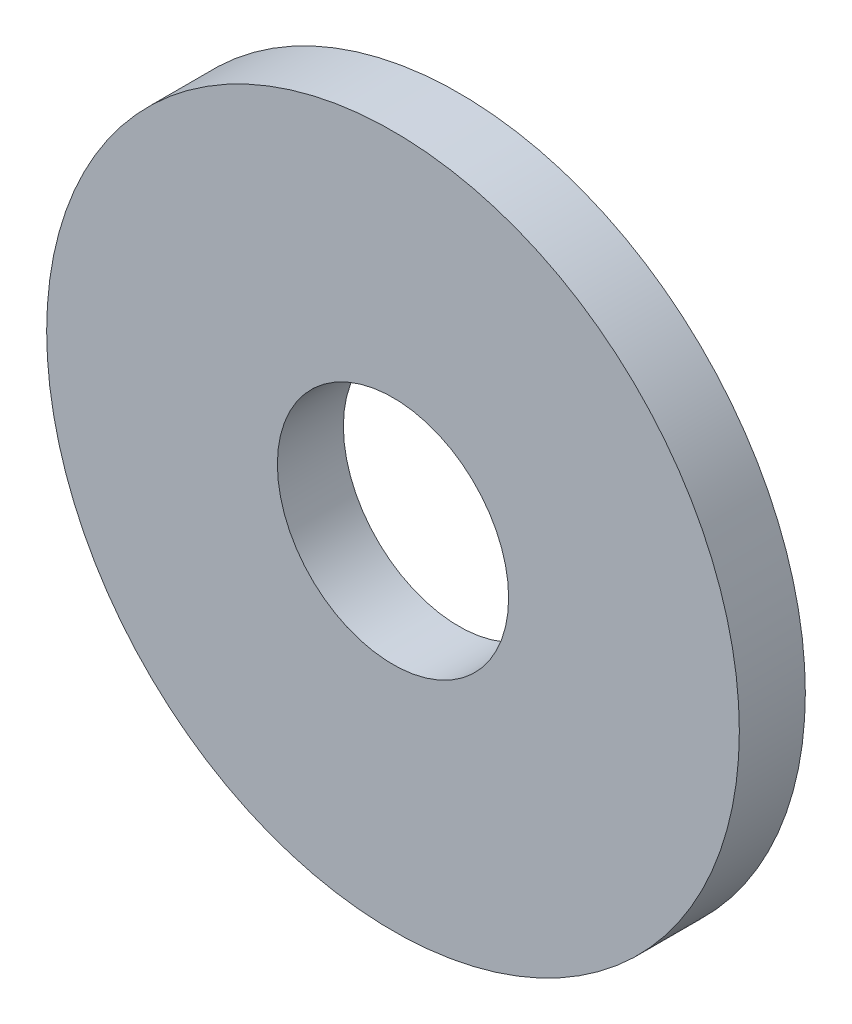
ISO-10303-21;
HEADER;
FILE_DESCRIPTION(('STEP AP214'),'2;1');
FILE_NAME('part.step','',(''),(''),'','','');
FILE_SCHEMA(('AUTOMOTIVE_DESIGN { 1 0 10303 214 1 1 1 1 }'));
ENDSEC;
DATA;
#1=APPLICATION_CONTEXT('core data for automotive mechanical design processes');
#2=APPLICATION_PROTOCOL_DEFINITION('international standard','automotive_design',2000,#1);
#3=PRODUCT_CONTEXT('',#1,'mechanical');
#4=PRODUCT('Part','Part','',(#3));
#5=PRODUCT_RELATED_PRODUCT_CATEGORY('part','',(#4));
#6=PRODUCT_DEFINITION_FORMATION('','',#4);
#7=PRODUCT_DEFINITION_CONTEXT('part definition',#1,'design');
#8=PRODUCT_DEFINITION('design','',#6,#7);
#9=PRODUCT_DEFINITION_SHAPE('','',#8);
#10=(LENGTH_UNIT() NAMED_UNIT(*) SI_UNIT(.MILLI.,.METRE.));
#11=(NAMED_UNIT(*) PLANE_ANGLE_UNIT() SI_UNIT($,.RADIAN.));
#12=(NAMED_UNIT(*) SI_UNIT($,.STERADIAN.) SOLID_ANGLE_UNIT());
#13=UNCERTAINTY_MEASURE_WITH_UNIT(LENGTH_MEASURE(1.E-05),#10,'distance_accuracy_value','');
#14=(GEOMETRIC_REPRESENTATION_CONTEXT(3) GLOBAL_UNCERTAINTY_ASSIGNED_CONTEXT((#13)) GLOBAL_UNIT_ASSIGNED_CONTEXT((#10,
#11,#12)) REPRESENTATION_CONTEXT('',''));
#15=CARTESIAN_POINT('',(0.,0.,0.));
#16=DIRECTION('',(0.,0.,1.));
#17=DIRECTION('',(1.,0.,0.));
#18=AXIS2_PLACEMENT_3D('',#15,#16,#17);
#19=CARTESIAN_POINT('',(0.,0.,1.5875));
#20=DIRECTION('',(0.,0.,1.));
#21=DIRECTION('',(1.,0.,0.));
#22=AXIS2_PLACEMENT_3D('',#19,#20,#21);
#23=PLANE('',#22);
#24=CARTESIAN_POINT('',(0.,0.,1.5875));
#25=DIRECTION('',(0.,0.,1.));
#26=DIRECTION('',(1.,0.,0.));
#27=AXIS2_PLACEMENT_3D('',#24,#25,#26);
#28=CIRCLE('',#27,8.3312);
#29=CARTESIAN_POINT('',(8.3312,0.,1.5875));
#30=VERTEX_POINT('',#29);
#31=EDGE_CURVE('E10',#30,#30,#28,.T.);
#32=ORIENTED_EDGE('',*,*,#31,.T.);
#33=EDGE_LOOP('',(#32));
#34=FACE_BOUND('',#33,.T.);
#35=CARTESIAN_POINT('',(0.,0.,1.5875));
#36=DIRECTION('',(0.,0.,1.));
#37=DIRECTION('',(1.,0.,0.));
#38=AXIS2_PLACEMENT_3D('',#35,#36,#37);
#39=CIRCLE('',#38,2.7813);
#40=CARTESIAN_POINT('',(2.7813,0.,1.5875));
#41=VERTEX_POINT('',#40);
#42=EDGE_CURVE('E41',#41,#41,#39,.T.);
#43=ORIENTED_EDGE('',*,*,#42,.F.);
#44=EDGE_LOOP('',(#43));
#45=FACE_BOUND('',#44,.T.);
#46=ADVANCED_FACE('F30',(#34,#45),#23,.T.);
#47=CARTESIAN_POINT('',(0.,0.,0.));
#48=DIRECTION('',(0.,0.,1.));
#49=DIRECTION('',(1.,0.,0.));
#50=AXIS2_PLACEMENT_3D('',#47,#48,#49);
#51=PLANE('',#50);
#52=CARTESIAN_POINT('',(0.,0.,0.));
#53=DIRECTION('',(0.,0.,1.));
#54=DIRECTION('',(1.,0.,0.));
#55=AXIS2_PLACEMENT_3D('',#52,#53,#54);
#56=CIRCLE('',#55,8.3312);
#57=CARTESIAN_POINT('',(8.3312,0.,0.));
#58=VERTEX_POINT('',#57);
#59=EDGE_CURVE('E34',#58,#58,#56,.T.);
#60=ORIENTED_EDGE('',*,*,#59,.F.);
#61=EDGE_LOOP('',(#60));
#62=FACE_BOUND('',#61,.T.);
#63=CARTESIAN_POINT('',(0.,0.,0.));
#64=DIRECTION('',(0.,0.,1.));
#65=DIRECTION('',(1.,0.,0.));
#66=AXIS2_PLACEMENT_3D('',#63,#64,#65);
#67=CIRCLE('',#66,2.7813);
#68=CARTESIAN_POINT('',(2.7813,0.,0.));
#69=VERTEX_POINT('',#68);
#70=EDGE_CURVE('E43',#69,#69,#67,.T.);
#71=ORIENTED_EDGE('',*,*,#70,.T.);
#72=EDGE_LOOP('',(#71));
#73=FACE_BOUND('',#72,.T.);
#74=ADVANCED_FACE('F53',(#62,#73),#51,.F.);
#75=CARTESIAN_POINT('',(0.,0.,1.5875));
#76=DIRECTION('',(0.,0.,-1.));
#77=DIRECTION('',(-1.,0.,0.));
#78=AXIS2_PLACEMENT_3D('',#75,#76,#77);
#79=CYLINDRICAL_SURFACE('',#78,8.3312);
#80=ORIENTED_EDGE('',*,*,#31,.F.);
#81=EDGE_LOOP('',(#80));
#82=FACE_BOUND('',#81,.T.);
#83=ORIENTED_EDGE('',*,*,#59,.T.);
#84=EDGE_LOOP('',(#83));
#85=FACE_BOUND('',#84,.T.);
#86=ADVANCED_FACE('F32',(#82,#85),#79,.T.);
#87=CARTESIAN_POINT('',(0.,0.,1.5875));
#88=DIRECTION('',(0.,0.,-1.));
#89=DIRECTION('',(-1.,0.,0.));
#90=AXIS2_PLACEMENT_3D('',#87,#88,#89);
#91=CYLINDRICAL_SURFACE('',#90,2.7813);
#92=ORIENTED_EDGE('',*,*,#42,.T.);
#93=EDGE_LOOP('',(#92));
#94=FACE_BOUND('',#93,.T.);
#95=ORIENTED_EDGE('',*,*,#70,.F.);
#96=EDGE_LOOP('',(#95));
#97=FACE_BOUND('',#96,.T.);
#98=ADVANCED_FACE('F49',(#94,#97),#91,.F.);
#99=CLOSED_SHELL('',(#46,#74,#86,#98));
#100=MANIFOLD_SOLID_BREP('B2',#99);
#101=ADVANCED_BREP_SHAPE_REPRESENTATION('',(#18,#100),#14);
#102=SHAPE_DEFINITION_REPRESENTATION(#9,#101);
ENDSEC;
END-ISO-10303-21;
